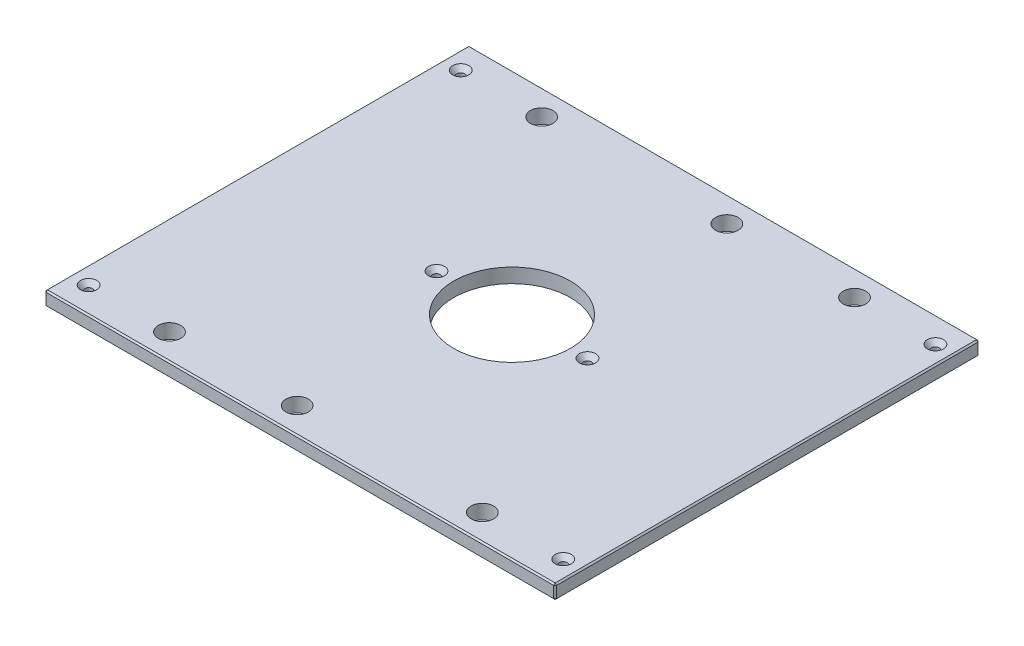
from build123d import *

# Parameters (mm, degrees)
SKETCH1_W                                        = 450.85
SKETCH1_H                                        = 374.65
BOSS_EXTRUDE1_DEPTH                              = 12.7
SKETCH13_R                                       = 51.562
CUT_EXTRUDE6_DEPTH                               = 294.374123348
F_25_32_0_78125_DIAMETER_HOLE1_D                 = 19.84375
CHAMFER2_SIZE                                    = 1.27
CSK_FOR_1_4_FLAT_HEAD_MACHINE_SCREW1_D           = 6.7564
CSK_FOR_1_4_FLAT_HEAD_MACHINE_SCREW1_CSINK_D     = 14.2748
CSK_FOR_1_4_FLAT_HEAD_MACHINE_SCREW1_CSINK_ANGLE = 82


with BuildPart() as part:
    # Sketch1 → Boss-Extrude1 (new body)
    with BuildSketch(Plane(origin=(0, 0, 0), x_dir=(1, 0, 0), z_dir=(0, 1, 0))):
        Rectangle(SKETCH1_W, SKETCH1_H)
    extrude(amount=BOSS_EXTRUDE1_DEPTH)

    # Sketch13 → Cut-Extrude6 (cut, through all)
    with BuildSketch(Plane(origin=(0, 12.7, 0), x_dir=(1, 0, 0), z_dir=(0, 1, 0))):
        with Locations(Location((0, 0, 0), (0, 0, 270))):
            Circle(SKETCH13_R)
    extrude(amount=-CUT_EXTRUDE6_DEPTH, mode=Mode.SUBTRACT)

    # 25_32 _0.78125_ Diameter Hole1 (through all)
    with Locations(Plane(origin=(0, 12.7, 0), x_dir=(1, 0, 0), z_dir=(0, 1, 0))):
        with Locations((138.1125, 164.30498), (-138.1125, 164.30498), (138.1125, -164.30498), (-138.1125, -164.30498), (25.4, 164.30498), (-25.4, -164.30498)):
            Hole(F_25_32_0_78125_DIAMETER_HOLE1_D / 2)

    # Chamfer2
    chamfer2_edges = [part.edges().sort_by_distance(p)[0] for p in [
        (225.425, 12.7, 0),
        (0, 12.7, -187.325),
        (-225.425, 12.7, 0),
        (0, 0, -187.325),
        (225.425, 0, 0),
        (0, 0, 187.325),
        (-225.425, 0, 0),
        (0, 12.7, 187.325),
        (-225.425, 6.35, -187.325),
        (225.425, 6.35, -187.325),
        (225.425, 6.35, 187.325),
        (-225.425, 6.35, 187.325),
    ]]
    chamfer(chamfer2_edges, length=CHAMFER2_SIZE)

    # CSK for 1_4 Flat Head Machine Screw1 (through all)
    with Locations(Plane(origin=(0, 12.7, 0), x_dir=(1, 0, 0), z_dir=(0, 1, 0))):
        with Locations((209.55, 164.30498), (209.55, -164.30498), (-209.55, -164.30498), (-66.675, 0), (66.675, 0), (-209.55, 164.30498), (-138.1125, 164.30498), (-138.1125, -164.30498)):
            CounterSinkHole(CSK_FOR_1_4_FLAT_HEAD_MACHINE_SCREW1_D / 2, CSK_FOR_1_4_FLAT_HEAD_MACHINE_SCREW1_CSINK_D / 2, counter_sink_angle=CSK_FOR_1_4_FLAT_HEAD_MACHINE_SCREW1_CSINK_ANGLE)


solid = part.part
